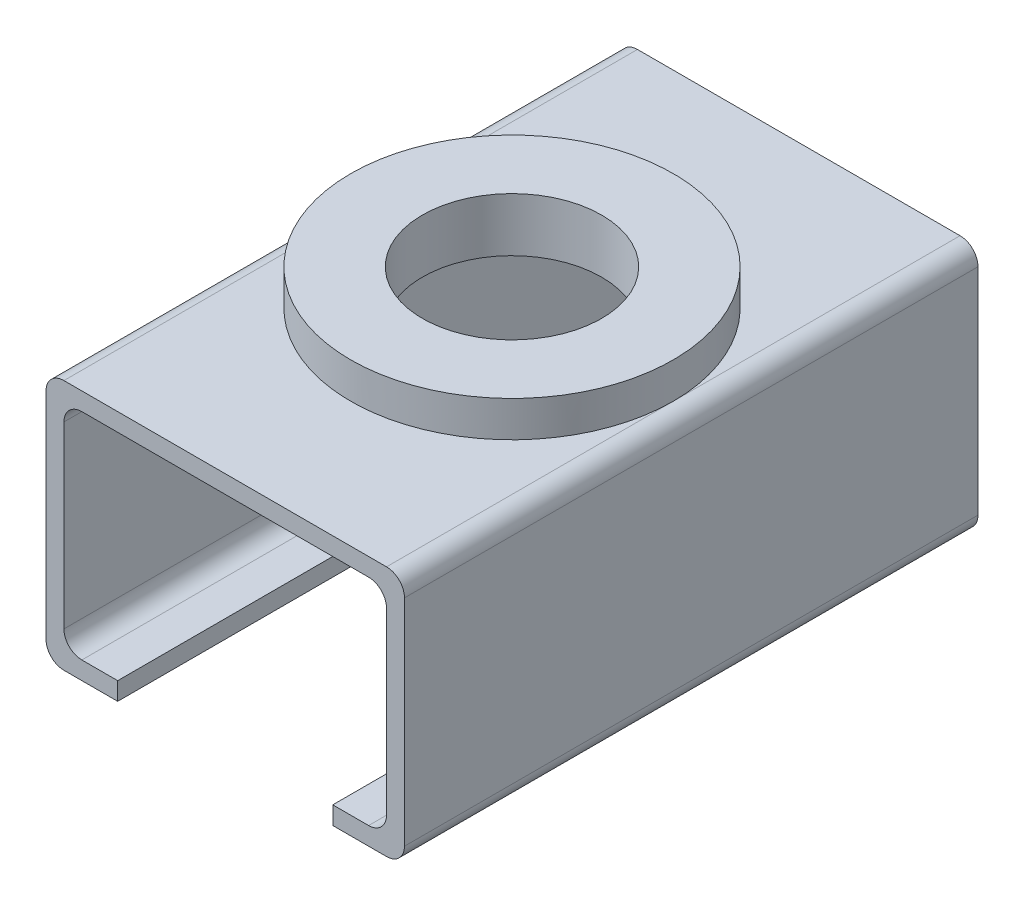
from build123d import *

# Parameters (mm, degrees)
EXTRUSION1_DEPTH        = 16
EXTRUSION1_DEPTH_BACK   = 16
ESQUISSE3_R             = 9
EXTRUSION2_DEPTH        = 2
ESQUISSE2_R             = 5
ENL_V_MAT_EXTRU_1_DEPTH = 23.912878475


with BuildPart() as part:
    # Esquisse1 → Extrusion1 (new, two sides: drawn at the far end of the back side and taken through both)
    with BuildSketch(Plane.XY.offset(-EXTRUSION1_DEPTH_BACK)):
        with BuildLine():
            Line((-6, 0), (-9, 0))
            ThreePointArc((-9, 0), (-9.707106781, 0.292893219), (-10, 1))
            Line((-10, 1), (-10, 13))
            ThreePointArc((-10, 13), (-9.707106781, 13.707106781), (-9, 14))
            Line((-9, 14), (9, 14))
            ThreePointArc((9, 14), (9.707106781, 13.707106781), (10, 13))
            Line((10, 13), (10, 1))
            ThreePointArc((10, 1), (9.707106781, 0.292893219), (9, 0))
            Line((9, 0), (6, 0))
            Line((6, 0), (6, 1))
            Line((6, 1), (8, 1))
            ThreePointArc((8, 1), (8.707106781, 1.292893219), (9, 2))
            Line((9, 2), (9, 12))
            ThreePointArc((9, 12), (8.707106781, 12.707106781), (8, 13))
            Line((8, 13), (-8, 13))
            ThreePointArc((-8, 13), (-8.707106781, 12.707106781), (-9, 12))
            Line((-9, 12), (-9, 2))
            ThreePointArc((-9, 2), (-8.707106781, 1.292893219), (-8, 1))
            Line((-8, 1), (-6, 1))
            Line((-6, 1), (-6, 0))
        make_face()
    extrude(amount=EXTRUSION1_DEPTH + EXTRUSION1_DEPTH_BACK)

    # Esquisse3 → Extrusion2 (add)
    with BuildSketch(Plane(origin=(0, 14, 0), x_dir=(-1, 0, 0), z_dir=(0, 1, 0))):
        Circle(ESQUISSE3_R)
    extrude(amount=EXTRUSION2_DEPTH)

    # Esquisse2 → Enl_v. mat.-Extru.1 (cut, through all)
    with BuildSketch(Plane.XZ.offset(-13)):
        with Locations(Location((0, 0, 0), (0, 0, 270))):
            Circle(ESQUISSE2_R)
    extrude(amount=-ENL_V_MAT_EXTRU_1_DEPTH, mode=Mode.SUBTRACT)


solid = part.part
